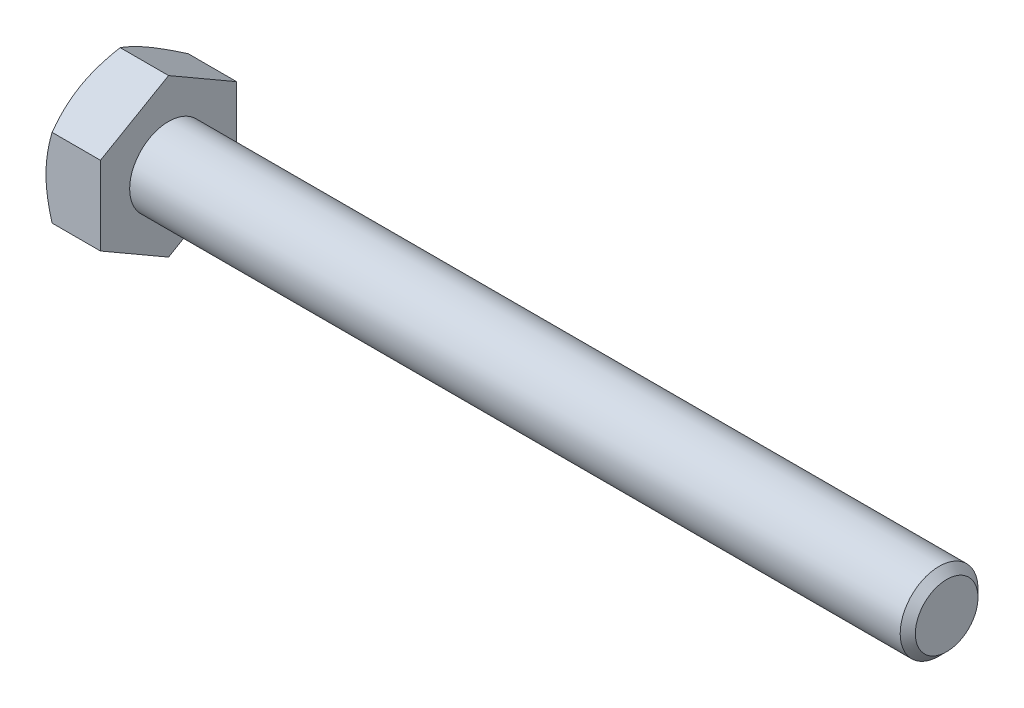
ISO-10303-21;
HEADER;
FILE_DESCRIPTION(('STEP AP214'),'2;1');
FILE_NAME('part.step','',(''),(''),'','','');
FILE_SCHEMA(('AUTOMOTIVE_DESIGN { 1 0 10303 214 1 1 1 1 }'));
ENDSEC;
DATA;
#1=APPLICATION_CONTEXT('core data for automotive mechanical design processes');
#2=APPLICATION_PROTOCOL_DEFINITION('international standard','automotive_design',2000,#1);
#3=PRODUCT_CONTEXT('',#1,'mechanical');
#4=PRODUCT('Part','Part','',(#3));
#5=PRODUCT_RELATED_PRODUCT_CATEGORY('part','',(#4));
#6=PRODUCT_DEFINITION_FORMATION('','',#4);
#7=PRODUCT_DEFINITION_CONTEXT('part definition',#1,'design');
#8=PRODUCT_DEFINITION('design','',#6,#7);
#9=PRODUCT_DEFINITION_SHAPE('','',#8);
#10=(LENGTH_UNIT() NAMED_UNIT(*) SI_UNIT(.MILLI.,.METRE.));
#11=(NAMED_UNIT(*) PLANE_ANGLE_UNIT() SI_UNIT($,.RADIAN.));
#12=(NAMED_UNIT(*) SI_UNIT($,.STERADIAN.) SOLID_ANGLE_UNIT());
#13=UNCERTAINTY_MEASURE_WITH_UNIT(LENGTH_MEASURE(1.E-05),#10,'distance_accuracy_value','');
#14=(GEOMETRIC_REPRESENTATION_CONTEXT(3) GLOBAL_UNCERTAINTY_ASSIGNED_CONTEXT((#13)) GLOBAL_UNIT_ASSIGNED_CONTEXT((#10,
#11,#12)) REPRESENTATION_CONTEXT('',''));
#15=CARTESIAN_POINT('',(0.,0.,0.));
#16=DIRECTION('',(0.,0.,1.));
#17=DIRECTION('',(1.,0.,0.));
#18=AXIS2_PLACEMENT_3D('',#15,#16,#17);
#19=CARTESIAN_POINT('',(2.8,2.02072594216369,-3.5));
#20=DIRECTION('',(0.,-0.866025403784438,0.500000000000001));
#21=DIRECTION('',(0.,-0.500000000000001,-0.866025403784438));
#22=AXIS2_PLACEMENT_3D('',#19,#20,#21);
#23=PLANE('',#22);
#24=CARTESIAN_POINT('',(0.312674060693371,4.04156735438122,0.0002));
#25=CARTESIAN_POINT('',(0.261385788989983,3.9527667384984,-0.15360717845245));
#26=CARTESIAN_POINT('',(0.214740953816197,3.86319960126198,-0.308742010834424));
#27=CARTESIAN_POINT('',(0.133321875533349,3.68251437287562,-0.621698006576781));
#28=CARTESIAN_POINT('',(0.0985764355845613,3.59139307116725,-0.779524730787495));
#29=CARTESIAN_POINT('',(0.0444900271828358,3.41027974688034,-1.09322221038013));
#30=CARTESIAN_POINT('',(0.024789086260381,3.32031559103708,-1.24904469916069));
#31=CARTESIAN_POINT('',(0.00127013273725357,3.13996396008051,-1.56142288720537));
#32=CARTESIAN_POINT('',(-0.00256735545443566,3.04957714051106,-1.71797745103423));
#33=CARTESIAN_POINT('',(0.00541530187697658,2.88068384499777,-2.01050921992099));
#34=CARTESIAN_POINT('',(0.0152754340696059,2.80215208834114,-2.14653021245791));
#35=CARTESIAN_POINT('',(0.046526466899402,2.64560020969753,-2.41768602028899));
#36=CARTESIAN_POINT('',(0.0679280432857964,2.56758062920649,-2.55281989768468));
#37=CARTESIAN_POINT('',(0.121430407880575,2.41070596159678,-2.82453479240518));
#38=CARTESIAN_POINT('',(0.153757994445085,2.33187072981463,-2.96108141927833));
#39=CARTESIAN_POINT('',(0.227128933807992,2.17537608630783,-3.2321380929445));
#40=CARTESIAN_POINT('',(0.268155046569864,2.09771466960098,-3.36665161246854));
#41=CARTESIAN_POINT('',(0.312674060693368,2.02061047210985,-3.5002));
#42=B_SPLINE_CURVE_WITH_KNOTS('',3,(#24,#25,#26,#27,#28,#29,#30,#31,#32,#33,#34,#35,#36,#37,#38,
#39,#40,#41),.UNSPECIFIED.,.F.,.F.,(4,2,2,2,2,2,2,2,4),(0.,0.554793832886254,1.11092123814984,
1.65328467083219,2.19498204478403,2.6666513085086,3.13875761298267,3.6213361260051,
4.10296698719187),.UNSPECIFIED.);
#43=CARTESIAN_POINT('',(0.312607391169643,4.04145188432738,0.));
#44=VERTEX_POINT('',#43);
#45=CARTESIAN_POINT('',(0.,3.03108891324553,-1.75));
#46=VERTEX_POINT('',#45);
#47=EDGE_CURVE('E55',#44,#46,#42,.T.);
#48=ORIENTED_EDGE('',*,*,#47,.F.);
#49=DIRECTION('',(-1.,0.,0.));
#50=VECTOR('',#49,1.);
#51=CARTESIAN_POINT('',(2.8,4.04145188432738,0.));
#52=LINE('',#51,#50);
#53=CARTESIAN_POINT('',(2.8,4.04145188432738,0.));
#54=VERTEX_POINT('',#53);
#55=EDGE_CURVE('E151',#54,#44,#52,.T.);
#56=ORIENTED_EDGE('',*,*,#55,.F.);
#57=DIRECTION('',(0.,0.500000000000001,0.866025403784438));
#58=VECTOR('',#57,1.);
#59=CARTESIAN_POINT('',(2.8,2.02072594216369,-3.5));
#60=LINE('',#59,#58);
#61=CARTESIAN_POINT('',(2.8,2.02072594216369,-3.5));
#62=VERTEX_POINT('',#61);
#63=EDGE_CURVE('E242',#62,#54,#60,.T.);
#64=ORIENTED_EDGE('',*,*,#63,.F.);
#65=DIRECTION('',(-1.,0.,0.));
#66=VECTOR('',#65,1.);
#67=CARTESIAN_POINT('',(2.8,2.02072594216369,-3.5));
#68=LINE('',#67,#66);
#69=CARTESIAN_POINT('',(0.31260739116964,2.02072594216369,-3.5));
#70=VERTEX_POINT('',#69);
#71=EDGE_CURVE('E139',#62,#70,#68,.T.);
#72=ORIENTED_EDGE('',*,*,#71,.T.);
#73=EDGE_CURVE('E133',#46,#70,#42,.T.);
#74=ORIENTED_EDGE('',*,*,#73,.F.);
#75=EDGE_LOOP('',(#48,#56,#64,#72,#74));
#76=FACE_BOUND('',#75,.T.);
#77=ADVANCED_FACE('F39',(#76),#23,.F.);
#78=CARTESIAN_POINT('',(2.8,4.04145188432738,0.));
#79=DIRECTION('',(0.,-0.866025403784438,-0.500000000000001));
#80=DIRECTION('',(0.,0.500000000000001,-0.866025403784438));
#81=AXIS2_PLACEMENT_3D('',#78,#79,#80);
#82=PLANE('',#81);
#83=CARTESIAN_POINT('',(0.312674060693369,2.02061047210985,3.5002));
#84=CARTESIAN_POINT('',(0.261385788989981,2.10941108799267,3.34639282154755));
#85=CARTESIAN_POINT('',(0.214740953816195,2.19897822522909,3.19125798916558));
#86=CARTESIAN_POINT('',(0.133321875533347,2.37966345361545,2.87830199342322));
#87=CARTESIAN_POINT('',(0.0985764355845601,2.47078475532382,2.72047526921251));
#88=CARTESIAN_POINT('',(0.0444900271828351,2.65189807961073,2.40677778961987));
#89=CARTESIAN_POINT('',(0.0247890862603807,2.74186223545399,2.25095530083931));
#90=CARTESIAN_POINT('',(0.00127013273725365,2.92221386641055,1.93857711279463));
#91=CARTESIAN_POINT('',(-0.00256735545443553,3.01260068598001,1.78202254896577));
#92=CARTESIAN_POINT('',(0.00541530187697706,3.1814939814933,1.48949078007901));
#93=CARTESIAN_POINT('',(0.0152754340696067,3.26002573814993,1.3534697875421));
#94=CARTESIAN_POINT('',(0.0465264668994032,3.41657761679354,1.08231397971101));
#95=CARTESIAN_POINT('',(0.0679280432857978,3.49459719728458,0.947180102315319));
#96=CARTESIAN_POINT('',(0.121430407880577,3.65147186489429,0.675465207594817));
#97=CARTESIAN_POINT('',(0.153757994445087,3.73030709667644,0.538918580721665));
#98=CARTESIAN_POINT('',(0.227128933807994,3.88680174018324,0.267861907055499));
#99=CARTESIAN_POINT('',(0.268155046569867,3.96446315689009,0.133348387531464));
#100=CARTESIAN_POINT('',(0.312674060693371,4.04156735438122,-0.000200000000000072));
#101=B_SPLINE_CURVE_WITH_KNOTS('',3,(#83,#84,#85,#86,#87,#88,#89,#90,#91,#92,#93,#94,#95,#96,
#97,#98,#99,#100),.UNSPECIFIED.,.F.,.F.,(4,2,2,2,2,2,2,2,4),(0.,0.554793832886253,
1.11092123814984,1.65328467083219,2.19498204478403,2.6666513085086,3.13875761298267,
3.6213361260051,4.10296698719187),.UNSPECIFIED.);
#102=CARTESIAN_POINT('',(0.312607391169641,2.02072594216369,3.5));
#103=VERTEX_POINT('',#102);
#104=CARTESIAN_POINT('',(0.,3.03108891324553,1.75));
#105=VERTEX_POINT('',#104);
#106=EDGE_CURVE('E62',#103,#105,#101,.T.);
#107=ORIENTED_EDGE('',*,*,#106,.F.);
#108=DIRECTION('',(-1.,0.,0.));
#109=VECTOR('',#108,1.);
#110=CARTESIAN_POINT('',(2.8,2.02072594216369,3.5));
#111=LINE('',#110,#109);
#112=CARTESIAN_POINT('',(2.8,2.02072594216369,3.5));
#113=VERTEX_POINT('',#112);
#114=EDGE_CURVE('E149',#113,#103,#111,.T.);
#115=ORIENTED_EDGE('',*,*,#114,.F.);
#116=DIRECTION('',(0.,-0.500000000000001,0.866025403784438));
#117=VECTOR('',#116,1.);
#118=CARTESIAN_POINT('',(2.8,4.04145188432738,0.));
#119=LINE('',#118,#117);
#120=EDGE_CURVE('E240',#54,#113,#119,.T.);
#121=ORIENTED_EDGE('',*,*,#120,.F.);
#122=ORIENTED_EDGE('',*,*,#55,.T.);
#123=EDGE_CURVE('E166',#105,#44,#101,.T.);
#124=ORIENTED_EDGE('',*,*,#123,.F.);
#125=EDGE_LOOP('',(#107,#115,#121,#122,#124));
#126=FACE_BOUND('',#125,.T.);
#127=ADVANCED_FACE('F172',(#126),#82,.F.);
#128=CARTESIAN_POINT('',(2.8,2.02072594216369,3.5));
#129=DIRECTION('',(0.,0.,-1.));
#130=DIRECTION('',(0.,1.,0.));
#131=AXIS2_PLACEMENT_3D('',#128,#129,#130);
#132=PLANE('',#131);
#133=CARTESIAN_POINT('',(1.74876972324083,-5.51155991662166,3.5));
#134=CARTESIAN_POINT('',(1.67392336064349,-5.35795146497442,3.5));
#135=CARTESIAN_POINT('',(1.59977092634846,-5.20399921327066,3.5));
#136=CARTESIAN_POINT('',(1.45324265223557,-4.89522455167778,3.5));
#137=CARTESIAN_POINT('',(1.38086707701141,-4.74040201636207,3.5));
#138=CARTESIAN_POINT('',(1.23793493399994,-4.42894615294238,3.5));
#139=CARTESIAN_POINT('',(1.1673897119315,-4.27230760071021,3.5));
#140=CARTESIAN_POINT('',(1.02907715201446,-3.95781335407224,3.5));
#141=CARTESIAN_POINT('',(0.961309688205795,-3.79995771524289,3.5));
#142=CARTESIAN_POINT('',(0.82704925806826,-3.47741113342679,3.5));
#143=CARTESIAN_POINT('',(0.760677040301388,-3.31266966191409,3.5));
#144=CARTESIAN_POINT('',(0.632756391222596,-2.9812905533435,3.5));
#145=CARTESIAN_POINT('',(0.571208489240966,-2.81465271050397,3.5));
#146=CARTESIAN_POINT('',(0.454490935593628,-2.47950135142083,3.5));
#147=CARTESIAN_POINT('',(0.399309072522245,-2.31099212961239,3.5));
#148=CARTESIAN_POINT('',(0.297038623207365,-1.97155788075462,3.5));
#149=CARTESIAN_POINT('',(0.249947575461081,-1.80063360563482,3.5));
#150=CARTESIAN_POINT('',(0.166312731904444,-1.4572176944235,3.5));
#151=CARTESIAN_POINT('',(0.129709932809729,-1.2847406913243,3.5));
#152=CARTESIAN_POINT('',(0.0690664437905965,-0.937557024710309,3.5));
#153=CARTESIAN_POINT('',(0.0450243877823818,-0.762850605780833,3.5));
#154=CARTESIAN_POINT('',(0.0117307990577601,-0.414396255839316,3.5));
#155=CARTESIAN_POINT('',(0.00228260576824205,-0.240667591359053,3.5));
#156=CARTESIAN_POINT('',(-0.00154556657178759,0.106974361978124,3.5));
#157=CARTESIAN_POINT('',(0.00407467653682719,0.280887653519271,3.5));
#158=CARTESIAN_POINT('',(0.0258160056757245,0.57367773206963,3.5));
#159=CARTESIAN_POINT('',(0.0381294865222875,0.692856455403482,3.5));
#160=CARTESIAN_POINT('',(0.0691104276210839,0.930390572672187,3.5));
#161=CARTESIAN_POINT('',(0.0877786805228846,1.04874586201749,3.5));
#162=CARTESIAN_POINT('',(0.152339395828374,1.40238821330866,3.5));
#163=CARTESIAN_POINT('',(0.206777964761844,1.63613518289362,3.5));
#164=CARTESIAN_POINT('',(0.301818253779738,1.98584040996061,3.5));
#165=CARTESIAN_POINT('',(0.336200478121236,2.10359260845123,3.5));
#166=CARTESIAN_POINT('',(0.408694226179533,2.33795453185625,3.5));
#167=CARTESIAN_POINT('',(0.44680577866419,2.45456424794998,3.5));
#168=CARTESIAN_POINT('',(0.526133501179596,2.68667648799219,3.5));
#169=CARTESIAN_POINT('',(0.567348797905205,2.80217931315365,3.5));
#170=CARTESIAN_POINT('',(0.652383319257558,3.03221622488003,3.5));
#171=CARTESIAN_POINT('',(0.696202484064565,3.14675033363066,3.5));
#172=CARTESIAN_POINT('',(0.817586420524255,3.45518824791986,3.5));
#173=CARTESIAN_POINT('',(0.897216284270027,3.64827858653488,3.5));
#174=CARTESIAN_POINT('',(1.06116121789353,4.03246734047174,3.5));
#175=CARTESIAN_POINT('',(1.14547680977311,4.22356553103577,3.5));
#176=CARTESIAN_POINT('',(1.31768022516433,4.60422080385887,3.5));
#177=CARTESIAN_POINT('',(1.40556928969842,4.79377732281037,3.5));
#178=CARTESIAN_POINT('',(1.5840729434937,5.17160543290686,3.5));
#179=CARTESIAN_POINT('',(1.67468761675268,5.3598769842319,3.5));
#180=CARTESIAN_POINT('',(1.85818750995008,5.73567568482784,3.5));
#181=CARTESIAN_POINT('',(1.95107608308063,5.92320119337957,3.5));
#182=CARTESIAN_POINT('',(2.13854805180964,6.29740401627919,3.5));
#183=CARTESIAN_POINT('',(2.23313146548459,6.48408132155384,3.5));
#184=CARTESIAN_POINT('',(2.51886265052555,7.04299370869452,3.5));
#185=CARTESIAN_POINT('',(2.71203324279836,7.41419418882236,3.5));
#186=CARTESIAN_POINT('',(3.08131090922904,8.11545297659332,3.5));
#187=CARTESIAN_POINT('',(3.257056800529,8.44570240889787,3.5));
#188=CARTESIAN_POINT('',(3.61066708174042,9.10509095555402,3.5));
#189=CARTESIAN_POINT('',(3.78853160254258,9.43422999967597,3.5));
#190=CARTESIAN_POINT('',(4.14522643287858,10.0905480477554,3.5));
#191=CARTESIAN_POINT('',(4.32405147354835,10.4177299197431,3.5));
#192=CARTESIAN_POINT('',(4.68290305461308,11.0714005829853,3.5));
#193=CARTESIAN_POINT('',(4.86292949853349,11.3978894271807,3.5));
#194=CARTESIAN_POINT('',(5.04339321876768,11.7241348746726,3.5));
#195=B_SPLINE_CURVE_WITH_KNOTS('',3,(#133,#134,#135,#136,#137,#138,#139,#140,#141,#142,#143,
#144,#145,#146,#147,#148,#149,#150,#151,#152,#153,#154,#155,#156,#157,#158,#159,#160,#161,#162,
#163,#164,#165,#166,#167,#168,#169,#170,#171,#172,#173,#174,#175,#176,#177,#178,#179,#180,#181,
#182,#183,#184,#185,#186,#187,#188,#189,#190,#191,#192,#193,#194),.UNSPECIFIED.,.F.,.F.,(4,2,2,
2,2,2,2,2,2,2,2,2,2,2,2,2,2,2,2,2,2,2,2,2,2,2,2,2,2,2,4),(0.,0.512624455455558,1.02532478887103,
1.54067716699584,2.05600615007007,2.58877526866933,3.12160276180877,3.65339055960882,
4.18501628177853,4.71358975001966,5.24210571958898,5.76343550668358,6.28477297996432,
6.64403977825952,7.00335140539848,7.72232402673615,8.09029790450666,8.45827462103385,
8.82614818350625,9.19401329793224,9.82051720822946,10.4470910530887,11.0738843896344,
11.7006970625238,12.3284975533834,12.9563047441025,14.211635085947,15.33392926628,
16.4562931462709,17.574877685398,18.6933734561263),.UNSPECIFIED.);
#196=CARTESIAN_POINT('',(0.31260739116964,-2.02072594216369,3.5));
#197=VERTEX_POINT('',#196);
#198=CARTESIAN_POINT('',(0.,0.,3.5));
#199=VERTEX_POINT('',#198);
#200=EDGE_CURVE('E252',#197,#199,#195,.T.);
#201=ORIENTED_EDGE('',*,*,#200,.F.);
#202=DIRECTION('',(-1.,0.,0.));
#203=VECTOR('',#202,1.);
#204=CARTESIAN_POINT('',(2.8,-2.02072594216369,3.5));
#205=LINE('',#204,#203);
#206=CARTESIAN_POINT('',(2.8,-2.02072594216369,3.5));
#207=VERTEX_POINT('',#206);
#208=EDGE_CURVE('E141',#207,#197,#205,.T.);
#209=ORIENTED_EDGE('',*,*,#208,.F.);
#210=DIRECTION('',(0.,-1.,0.));
#211=VECTOR('',#210,1.);
#212=CARTESIAN_POINT('',(2.8,2.02072594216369,3.5));
#213=LINE('',#212,#211);
#214=EDGE_CURVE('E236',#113,#207,#213,.T.);
#215=ORIENTED_EDGE('',*,*,#214,.F.);
#216=ORIENTED_EDGE('',*,*,#114,.T.);
#217=EDGE_CURVE('E190',#199,#103,#195,.T.);
#218=ORIENTED_EDGE('',*,*,#217,.F.);
#219=EDGE_LOOP('',(#201,#209,#215,#216,#218));
#220=FACE_BOUND('',#219,.T.);
#221=ADVANCED_FACE('F258',(#220),#132,.F.);
#222=CARTESIAN_POINT('',(2.8,-4.04145188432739,0.));
#223=DIRECTION('',(0.,0.866025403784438,-0.500000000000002));
#224=DIRECTION('',(0.,0.500000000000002,0.866025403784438));
#225=AXIS2_PLACEMENT_3D('',#222,#223,#224);
#226=PLANE('',#225);
#227=CARTESIAN_POINT('',(0.312674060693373,-4.04156735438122,-0.000200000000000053));
#228=CARTESIAN_POINT('',(0.261385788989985,-3.95276673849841,0.15360717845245));
#229=CARTESIAN_POINT('',(0.214740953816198,-3.86319960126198,0.308742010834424));
#230=CARTESIAN_POINT('',(0.13332187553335,-3.68251437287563,0.621698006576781));
#231=CARTESIAN_POINT('',(0.0985764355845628,-3.59139307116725,0.779524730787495));
#232=CARTESIAN_POINT('',(0.0444900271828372,-3.41027974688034,1.09322221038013));
#233=CARTESIAN_POINT('',(0.0247890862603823,-3.32031559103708,1.24904469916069));
#234=CARTESIAN_POINT('',(0.00127013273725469,-3.13996396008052,1.56142288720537));
#235=CARTESIAN_POINT('',(-0.00256735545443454,-3.04957714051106,1.71797745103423));
#236=CARTESIAN_POINT('',(0.00541530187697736,-2.88068384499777,2.01050921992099));
#237=CARTESIAN_POINT('',(0.0152754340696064,-2.80215208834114,2.14653021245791));
#238=CARTESIAN_POINT('',(0.0465264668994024,-2.64560020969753,2.41768602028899));
#239=CARTESIAN_POINT('',(0.067928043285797,-2.56758062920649,2.55281989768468));
#240=CARTESIAN_POINT('',(0.121430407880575,-2.41070596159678,2.82453479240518));
#241=CARTESIAN_POINT('',(0.153757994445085,-2.33187072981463,2.96108141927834));
#242=CARTESIAN_POINT('',(0.227128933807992,-2.17537608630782,3.2321380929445));
#243=CARTESIAN_POINT('',(0.268155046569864,-2.09771466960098,3.36665161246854));
#244=CARTESIAN_POINT('',(0.312674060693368,-2.02061047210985,3.5002));
#245=B_SPLINE_CURVE_WITH_KNOTS('',3,(#227,#228,#229,#230,#231,#232,#233,#234,#235,#236,#237,
#238,#239,#240,#241,#242,#243,#244),.UNSPECIFIED.,.F.,.F.,(4,2,2,2,2,2,2,2,4),(0.,
0.554793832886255,1.11092123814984,1.65328467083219,2.19498204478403,2.6666513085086,
3.13875761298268,3.6213361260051,4.10296698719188),.UNSPECIFIED.);
#246=CARTESIAN_POINT('',(0.312607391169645,-4.04145188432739,0.));
#247=VERTEX_POINT('',#246);
#248=CARTESIAN_POINT('',(0.,-3.03108891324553,1.75000000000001));
#249=VERTEX_POINT('',#248);
#250=EDGE_CURVE('E174',#247,#249,#245,.T.);
#251=ORIENTED_EDGE('',*,*,#250,.F.);
#252=DIRECTION('',(-1.,0.,0.));
#253=VECTOR('',#252,1.);
#254=CARTESIAN_POINT('',(2.8,-4.04145188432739,0.));
#255=LINE('',#254,#253);
#256=CARTESIAN_POINT('',(2.8,-4.04145188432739,0.));
#257=VERTEX_POINT('',#256);
#258=EDGE_CURVE('E138',#257,#247,#255,.T.);
#259=ORIENTED_EDGE('',*,*,#258,.F.);
#260=DIRECTION('',(0.,-0.500000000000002,-0.866025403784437));
#261=VECTOR('',#260,1.);
#262=CARTESIAN_POINT('',(2.8,-4.04145188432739,0.));
#263=LINE('',#262,#261);
#264=EDGE_CURVE('E234',#207,#257,#263,.T.);
#265=ORIENTED_EDGE('',*,*,#264,.F.);
#266=ORIENTED_EDGE('',*,*,#208,.T.);
#267=EDGE_CURVE('E176',#249,#197,#245,.T.);
#268=ORIENTED_EDGE('',*,*,#267,.F.);
#269=EDGE_LOOP('',(#251,#259,#265,#266,#268));
#270=FACE_BOUND('',#269,.T.);
#271=ADVANCED_FACE('F230',(#270),#226,.F.);
#272=CARTESIAN_POINT('',(2.8,-2.02072594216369,-3.5));
#273=DIRECTION('',(0.,0.866025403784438,0.5));
#274=DIRECTION('',(0.,-0.5,0.866025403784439));
#275=AXIS2_PLACEMENT_3D('',#272,#273,#274);
#276=PLANE('',#275);
#277=CARTESIAN_POINT('',(0.312674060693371,-2.02061047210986,-3.5002));
#278=CARTESIAN_POINT('',(0.261385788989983,-2.10941108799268,-3.34639282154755));
#279=CARTESIAN_POINT('',(0.214740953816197,-2.1989782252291,-3.19125798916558));
#280=CARTESIAN_POINT('',(0.13332187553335,-2.37966345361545,-2.87830199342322));
#281=CARTESIAN_POINT('',(0.0985764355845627,-2.47078475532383,-2.7204752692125));
#282=CARTESIAN_POINT('',(0.0444900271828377,-2.65189807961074,-2.40677778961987));
#283=CARTESIAN_POINT('',(0.0247890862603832,-2.741862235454,-2.25095530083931));
#284=CARTESIAN_POINT('',(0.00127013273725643,-2.92221386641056,-1.93857711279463));
#285=CARTESIAN_POINT('',(-0.00256735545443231,-3.01260068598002,-1.78202254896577));
#286=CARTESIAN_POINT('',(0.00541530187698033,-3.1814939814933,-1.48949078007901));
#287=CARTESIAN_POINT('',(0.0152754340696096,-3.26002573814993,-1.35346978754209));
#288=CARTESIAN_POINT('',(0.0465264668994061,-3.41657761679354,-1.08231397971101));
#289=CARTESIAN_POINT('',(0.0679280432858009,-3.49459719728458,-0.947180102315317));
#290=CARTESIAN_POINT('',(0.12143040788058,-3.65147186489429,-0.675465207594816));
#291=CARTESIAN_POINT('',(0.153757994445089,-3.73030709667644,-0.538918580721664));
#292=CARTESIAN_POINT('',(0.227128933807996,-3.88680174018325,-0.267861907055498));
#293=CARTESIAN_POINT('',(0.268155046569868,-3.96446315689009,-0.133348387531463));
#294=CARTESIAN_POINT('',(0.312674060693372,-4.04156735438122,0.000200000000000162));
#295=B_SPLINE_CURVE_WITH_KNOTS('',3,(#277,#278,#279,#280,#281,#282,#283,#284,#285,#286,#287,
#288,#289,#290,#291,#292,#293,#294),.UNSPECIFIED.,.F.,.F.,(4,2,2,2,2,2,2,2,4),(0.,
0.554793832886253,1.11092123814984,1.65328467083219,2.19498204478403,2.6666513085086,
3.13875761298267,3.6213361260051,4.10296698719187),.UNSPECIFIED.);
#296=CARTESIAN_POINT('',(0.312607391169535,-2.02072594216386,-3.5));
#297=VERTEX_POINT('',#296);
#298=CARTESIAN_POINT('',(0.,-3.03108891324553,-1.75));
#299=VERTEX_POINT('',#298);
#300=EDGE_CURVE('E115',#297,#299,#295,.T.);
#301=ORIENTED_EDGE('',*,*,#300,.F.);
#302=DIRECTION('',(-1.,0.,0.));
#303=VECTOR('',#302,1.);
#304=CARTESIAN_POINT('',(2.8,-2.02072594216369,-3.5));
#305=LINE('',#304,#303);
#306=CARTESIAN_POINT('',(2.8,-2.02072594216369,-3.5));
#307=VERTEX_POINT('',#306);
#308=EDGE_CURVE('E129',#307,#297,#305,.T.);
#309=ORIENTED_EDGE('',*,*,#308,.F.);
#310=DIRECTION('',(0.,0.5,-0.866025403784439));
#311=VECTOR('',#310,1.);
#312=CARTESIAN_POINT('',(2.8,-2.02072594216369,-3.5));
#313=LINE('',#312,#311);
#314=EDGE_CURVE('E232',#257,#307,#313,.T.);
#315=ORIENTED_EDGE('',*,*,#314,.F.);
#316=ORIENTED_EDGE('',*,*,#258,.T.);
#317=EDGE_CURVE('E132',#299,#247,#295,.T.);
#318=ORIENTED_EDGE('',*,*,#317,.F.);
#319=EDGE_LOOP('',(#301,#309,#315,#316,#318));
#320=FACE_BOUND('',#319,.T.);
#321=ADVANCED_FACE('F127',(#320),#276,.F.);
#322=CARTESIAN_POINT('',(2.8,2.02072594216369,-3.5));
#323=DIRECTION('',(0.,0.,1.));
#324=DIRECTION('',(0.,-1.,0.));
#325=AXIS2_PLACEMENT_3D('',#322,#323,#324);
#326=PLANE('',#325);
#327=CARTESIAN_POINT('',(1.74876972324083,-5.51155991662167,-3.5));
#328=CARTESIAN_POINT('',(1.6739233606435,-5.35795146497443,-3.5));
#329=CARTESIAN_POINT('',(1.59977092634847,-5.20399921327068,-3.5));
#330=CARTESIAN_POINT('',(1.45324265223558,-4.89522455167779,-3.5));
#331=CARTESIAN_POINT('',(1.38086707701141,-4.74040201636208,-3.5));
#332=CARTESIAN_POINT('',(1.23793493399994,-4.4289461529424,-3.5));
#333=CARTESIAN_POINT('',(1.1673897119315,-4.27230760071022,-3.5));
#334=CARTESIAN_POINT('',(1.02907715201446,-3.95781335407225,-3.5));
#335=CARTESIAN_POINT('',(0.9613096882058,-3.79995771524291,-3.5));
#336=CARTESIAN_POINT('',(0.827049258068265,-3.4774111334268,-3.5));
#337=CARTESIAN_POINT('',(0.760677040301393,-3.3126696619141,-3.5));
#338=CARTESIAN_POINT('',(0.632756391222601,-2.98129055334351,-3.5));
#339=CARTESIAN_POINT('',(0.57120848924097,-2.81465271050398,-3.5));
#340=CARTESIAN_POINT('',(0.454490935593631,-2.47950135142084,-3.5));
#341=CARTESIAN_POINT('',(0.399309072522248,-2.3109921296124,-3.5));
#342=CARTESIAN_POINT('',(0.297038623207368,-1.97155788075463,-3.5));
#343=CARTESIAN_POINT('',(0.249947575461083,-1.80063360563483,-3.5));
#344=CARTESIAN_POINT('',(0.166312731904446,-1.45721769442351,-3.5));
#345=CARTESIAN_POINT('',(0.12970993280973,-1.28474069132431,-3.5));
#346=CARTESIAN_POINT('',(0.0690664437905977,-0.937557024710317,-3.5));
#347=CARTESIAN_POINT('',(0.0450243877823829,-0.762850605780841,-3.5));
#348=CARTESIAN_POINT('',(0.0117307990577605,-0.414396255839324,-3.5));
#349=CARTESIAN_POINT('',(0.00228260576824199,-0.240667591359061,-3.5));
#350=CARTESIAN_POINT('',(-0.00154556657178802,0.106974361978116,-3.5));
#351=CARTESIAN_POINT('',(0.0040746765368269,0.280887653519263,-3.5));
#352=CARTESIAN_POINT('',(0.0258160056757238,0.573677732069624,-3.5));
#353=CARTESIAN_POINT('',(0.0381294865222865,0.692856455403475,-3.5));
#354=CARTESIAN_POINT('',(0.0691104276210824,0.93039057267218,-3.5));
#355=CARTESIAN_POINT('',(0.0877786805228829,1.04874586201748,-3.5));
#356=CARTESIAN_POINT('',(0.152339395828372,1.40238821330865,-3.5));
#357=CARTESIAN_POINT('',(0.206777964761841,1.63613518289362,-3.5));
#358=CARTESIAN_POINT('',(0.301818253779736,1.9858404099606,-3.5));
#359=CARTESIAN_POINT('',(0.336200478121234,2.10359260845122,-3.5));
#360=CARTESIAN_POINT('',(0.40869422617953,2.33795453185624,-3.5));
#361=CARTESIAN_POINT('',(0.446805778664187,2.45456424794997,-3.5));
#362=CARTESIAN_POINT('',(0.526133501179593,2.68667648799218,-3.5));
#363=CARTESIAN_POINT('',(0.567348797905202,2.80217931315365,-3.5));
#364=CARTESIAN_POINT('',(0.652383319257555,3.03221622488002,-3.5));
#365=CARTESIAN_POINT('',(0.696202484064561,3.14675033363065,-3.5));
#366=CARTESIAN_POINT('',(0.817586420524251,3.45518824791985,-3.5));
#367=CARTESIAN_POINT('',(0.897216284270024,3.64827858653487,-3.5));
#368=CARTESIAN_POINT('',(1.06116121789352,4.03246734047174,-3.5));
#369=CARTESIAN_POINT('',(1.1454768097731,4.22356553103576,-3.5));
#370=CARTESIAN_POINT('',(1.31768022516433,4.60422080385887,-3.5));
#371=CARTESIAN_POINT('',(1.40556928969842,4.79377732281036,-3.5));
#372=CARTESIAN_POINT('',(1.58407294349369,5.17160543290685,-3.5));
#373=CARTESIAN_POINT('',(1.67468761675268,5.35987698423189,-3.5));
#374=CARTESIAN_POINT('',(1.85818750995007,5.73567568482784,-3.5));
#375=CARTESIAN_POINT('',(1.95107608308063,5.92320119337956,-3.5));
#376=CARTESIAN_POINT('',(2.13854805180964,6.29740401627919,-3.5));
#377=CARTESIAN_POINT('',(2.23313146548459,6.48408132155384,-3.5));
#378=CARTESIAN_POINT('',(2.51886265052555,7.04299370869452,-3.5));
#379=CARTESIAN_POINT('',(2.71203324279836,7.41419418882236,-3.5));
#380=CARTESIAN_POINT('',(3.08131090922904,8.11545297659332,-3.5));
#381=CARTESIAN_POINT('',(3.257056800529,8.44570240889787,-3.5));
#382=CARTESIAN_POINT('',(3.61066708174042,9.10509095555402,-3.5));
#383=CARTESIAN_POINT('',(3.78853160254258,9.43422999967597,-3.5));
#384=CARTESIAN_POINT('',(4.14522643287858,10.0905480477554,-3.5));
#385=CARTESIAN_POINT('',(4.32405147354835,10.4177299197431,-3.5));
#386=CARTESIAN_POINT('',(4.68290305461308,11.0714005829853,-3.5));
#387=CARTESIAN_POINT('',(4.86292949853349,11.3978894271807,-3.5));
#388=CARTESIAN_POINT('',(5.04339321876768,11.7241348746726,-3.5));
#389=B_SPLINE_CURVE_WITH_KNOTS('',3,(#327,#328,#329,#330,#331,#332,#333,#334,#335,#336,#337,
#338,#339,#340,#341,#342,#343,#344,#345,#346,#347,#348,#349,#350,#351,#352,#353,#354,#355,#356,
#357,#358,#359,#360,#361,#362,#363,#364,#365,#366,#367,#368,#369,#370,#371,#372,#373,#374,#375,
#376,#377,#378,#379,#380,#381,#382,#383,#384,#385,#386,#387,#388),.UNSPECIFIED.,.F.,.F.,(4,2,2,
2,2,2,2,2,2,2,2,2,2,2,2,2,2,2,2,2,2,2,2,2,2,2,2,2,2,2,4),(0.,0.512624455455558,1.02532478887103,
1.54067716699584,2.05600615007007,2.58877526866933,3.12160276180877,3.65339055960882,
4.18501628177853,4.71358975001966,5.24210571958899,5.76343550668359,6.28477297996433,
6.64403977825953,7.00335140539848,7.72232402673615,8.09029790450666,8.45827462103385,
8.82614818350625,9.19401329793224,9.82051720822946,10.4470910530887,11.0738843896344,
11.7006970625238,12.3284975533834,12.9563047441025,14.211635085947,15.3339292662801,
16.4562931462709,17.574877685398,18.6933734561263),.UNSPECIFIED.);
#390=CARTESIAN_POINT('',(0.,0.,-3.5));
#391=VERTEX_POINT('',#390);
#392=EDGE_CURVE('E121',#70,#391,#389,.F.);
#393=ORIENTED_EDGE('',*,*,#392,.F.);
#394=ORIENTED_EDGE('',*,*,#71,.F.);
#395=DIRECTION('',(0.,1.,0.));
#396=VECTOR('',#395,1.);
#397=CARTESIAN_POINT('',(2.8,2.02072594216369,-3.5));
#398=LINE('',#397,#396);
#399=EDGE_CURVE('E137',#307,#62,#398,.T.);
#400=ORIENTED_EDGE('',*,*,#399,.F.);
#401=ORIENTED_EDGE('',*,*,#308,.T.);
#402=EDGE_CURVE('E112',#391,#297,#389,.F.);
#403=ORIENTED_EDGE('',*,*,#402,.F.);
#404=EDGE_LOOP('',(#393,#394,#400,#401,#403));
#405=FACE_BOUND('',#404,.T.);
#406=ADVANCED_FACE('F135',(#405),#326,.F.);
#407=CARTESIAN_POINT('',(2.8,4.04145188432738,0.));
#408=DIRECTION('',(1.,0.,0.));
#409=DIRECTION('',(0.,0.,-1.));
#410=AXIS2_PLACEMENT_3D('',#407,#408,#409);
#411=PLANE('',#410);
#412=CARTESIAN_POINT('',(2.8,0.,0.));
#413=DIRECTION('',(1.,0.,0.));
#414=DIRECTION('',(0.,0.,-1.));
#415=AXIS2_PLACEMENT_3D('',#412,#413,#414);
#416=CIRCLE('',#415,2.);
#417=CARTESIAN_POINT('',(2.8,0.,-2.));
#418=VERTEX_POINT('',#417);
#419=EDGE_CURVE('E245',#418,#418,#416,.F.);
#420=ORIENTED_EDGE('',*,*,#419,.T.);
#421=EDGE_LOOP('',(#420));
#422=FACE_BOUND('',#421,.T.);
#423=ORIENTED_EDGE('',*,*,#63,.T.);
#424=ORIENTED_EDGE('',*,*,#120,.T.);
#425=ORIENTED_EDGE('',*,*,#214,.T.);
#426=ORIENTED_EDGE('',*,*,#264,.T.);
#427=ORIENTED_EDGE('',*,*,#314,.T.);
#428=ORIENTED_EDGE('',*,*,#399,.T.);
#429=EDGE_LOOP('',(#423,#424,#425,#426,#427,#428));
#430=FACE_BOUND('',#429,.T.);
#431=ADVANCED_FACE('F260',(#422,#430),#411,.T.);
#432=CARTESIAN_POINT('',(0.,0.,0.));
#433=DIRECTION('',(-1.,0.,0.));
#434=DIRECTION('',(0.,0.,1.));
#435=AXIS2_PLACEMENT_3D('',#432,#433,#434);
#436=CYLINDRICAL_SURFACE('',#435,2.);
#437=ORIENTED_EDGE('',*,*,#419,.F.);
#438=EDGE_LOOP('',(#437));
#439=FACE_BOUND('',#438,.T.);
#440=CARTESIAN_POINT('',(42.41,0.,0.));
#441=DIRECTION('',(-1.,0.,0.));
#442=DIRECTION('',(0.,0.,1.));
#443=AXIS2_PLACEMENT_3D('',#440,#441,#442);
#444=CIRCLE('',#443,2.);
#445=CARTESIAN_POINT('',(42.41,0.,2.));
#446=VERTEX_POINT('',#445);
#447=EDGE_CURVE('E248',#446,#446,#444,.T.);
#448=ORIENTED_EDGE('',*,*,#447,.T.);
#449=EDGE_LOOP('',(#448));
#450=FACE_BOUND('',#449,.T.);
#451=ADVANCED_FACE('F291',(#439,#450),#436,.T.);
#452=CARTESIAN_POINT('',(42.8,0.,0.));
#453=DIRECTION('',(-1.,0.,0.));
#454=DIRECTION('',(0.,0.,1.));
#455=AXIS2_PLACEMENT_3D('',#452,#453,#454);
#456=CONICAL_SURFACE('',#455,1.61,0.785398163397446);
#457=ORIENTED_EDGE('',*,*,#447,.F.);
#458=EDGE_LOOP('',(#457));
#459=FACE_BOUND('',#458,.T.);
#460=CARTESIAN_POINT('',(42.8,0.,0.));
#461=DIRECTION('',(-1.,0.,0.));
#462=DIRECTION('',(0.,0.,1.));
#463=AXIS2_PLACEMENT_3D('',#460,#461,#462);
#464=CIRCLE('',#463,1.61);
#465=CARTESIAN_POINT('',(42.8,0.,1.61));
#466=VERTEX_POINT('',#465);
#467=EDGE_CURVE('E250',#466,#466,#464,.T.);
#468=ORIENTED_EDGE('',*,*,#467,.T.);
#469=EDGE_LOOP('',(#468));
#470=FACE_BOUND('',#469,.T.);
#471=ADVANCED_FACE('F294',(#459,#470),#456,.T.);
#472=CARTESIAN_POINT('',(42.8,0.,0.));
#473=DIRECTION('',(-1.,0.,0.));
#474=DIRECTION('',(0.,0.,1.));
#475=AXIS2_PLACEMENT_3D('',#472,#473,#474);
#476=PLANE('',#475);
#477=ORIENTED_EDGE('',*,*,#467,.F.);
#478=EDGE_LOOP('',(#477));
#479=FACE_BOUND('',#478,.T.);
#480=ADVANCED_FACE('F204',(#479),#476,.F.);
#481=CARTESIAN_POINT('',(0.,0.,0.));
#482=DIRECTION('',(1.,0.,0.));
#483=DIRECTION('',(0.,0.,-1.));
#484=AXIS2_PLACEMENT_3D('',#481,#482,#483);
#485=CONICAL_SURFACE('',#484,3.5,1.0471975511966);
#486=ORIENTED_EDGE('',*,*,#300,.T.);
#487=CARTESIAN_POINT('',(0.,0.,0.));
#488=DIRECTION('',(1.,0.,0.));
#489=DIRECTION('',(0.,0.,-1.));
#490=AXIS2_PLACEMENT_3D('',#487,#488,#489);
#491=CIRCLE('',#490,3.5);
#492=EDGE_CURVE('E43',#299,#391,#491,.T.);
#493=ORIENTED_EDGE('',*,*,#492,.T.);
#494=ORIENTED_EDGE('',*,*,#402,.T.);
#495=EDGE_LOOP('',(#486,#493,#494));
#496=FACE_BOUND('',#495,.T.);
#497=ADVANCED_FACE('F114',(#496),#485,.T.);
#498=ORIENTED_EDGE('',*,*,#250,.T.);
#499=EDGE_CURVE('E156',#249,#299,#491,.T.);
#500=ORIENTED_EDGE('',*,*,#499,.T.);
#501=ORIENTED_EDGE('',*,*,#317,.T.);
#502=EDGE_LOOP('',(#498,#500,#501));
#503=FACE_BOUND('',#502,.T.);
#504=ADVANCED_FACE('F203',(#503),#485,.T.);
#505=ORIENTED_EDGE('',*,*,#200,.T.);
#506=EDGE_CURVE('E157',#199,#249,#491,.T.);
#507=ORIENTED_EDGE('',*,*,#506,.T.);
#508=ORIENTED_EDGE('',*,*,#267,.T.);
#509=EDGE_LOOP('',(#505,#507,#508));
#510=FACE_BOUND('',#509,.T.);
#511=ADVANCED_FACE('F198',(#510),#485,.T.);
#512=ORIENTED_EDGE('',*,*,#217,.T.);
#513=ORIENTED_EDGE('',*,*,#106,.T.);
#514=CARTESIAN_POINT('',(0.,0.,0.));
#515=DIRECTION('',(-1.,0.,0.));
#516=DIRECTION('',(0.,0.,1.));
#517=AXIS2_PLACEMENT_3D('',#514,#515,#516);
#518=CIRCLE('',#517,3.5);
#519=EDGE_CURVE('E122',#199,#105,#518,.T.);
#520=ORIENTED_EDGE('',*,*,#519,.F.);
#521=EDGE_LOOP('',(#512,#513,#520));
#522=FACE_BOUND('',#521,.T.);
#523=ADVANCED_FACE('F202',(#522),#485,.T.);
#524=ORIENTED_EDGE('',*,*,#123,.T.);
#525=ORIENTED_EDGE('',*,*,#47,.T.);
#526=EDGE_CURVE('E48',#46,#105,#491,.T.);
#527=ORIENTED_EDGE('',*,*,#526,.T.);
#528=EDGE_LOOP('',(#524,#525,#527));
#529=FACE_BOUND('',#528,.T.);
#530=ADVANCED_FACE('F165',(#529),#485,.T.);
#531=ORIENTED_EDGE('',*,*,#73,.T.);
#532=ORIENTED_EDGE('',*,*,#392,.T.);
#533=EDGE_CURVE('E11',#391,#46,#491,.T.);
#534=ORIENTED_EDGE('',*,*,#533,.T.);
#535=EDGE_LOOP('',(#531,#532,#534));
#536=FACE_BOUND('',#535,.T.);
#537=ADVANCED_FACE('F263',(#536),#485,.T.);
#538=CARTESIAN_POINT('',(0.,4.04145188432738,0.));
#539=DIRECTION('',(1.,0.,0.));
#540=DIRECTION('',(0.,0.,-1.));
#541=AXIS2_PLACEMENT_3D('',#538,#539,#540);
#542=PLANE('',#541);
#543=ORIENTED_EDGE('',*,*,#533,.F.);
#544=ORIENTED_EDGE('',*,*,#492,.F.);
#545=ORIENTED_EDGE('',*,*,#499,.F.);
#546=ORIENTED_EDGE('',*,*,#506,.F.);
#547=ORIENTED_EDGE('',*,*,#519,.T.);
#548=ORIENTED_EDGE('',*,*,#526,.F.);
#549=EDGE_LOOP('',(#543,#544,#545,#546,#547,#548));
#550=FACE_BOUND('',#549,.T.);
#551=ADVANCED_FACE('F169',(#550),#542,.F.);
#552=CLOSED_SHELL('',(#77,#127,#221,#271,#321,#406,#431,#451,#471,#480,#497,#504,#511,#523,#530,
#537,#551));
#553=MANIFOLD_SOLID_BREP('B2',#552);
#554=ADVANCED_BREP_SHAPE_REPRESENTATION('',(#18,#553),#14);
#555=SHAPE_DEFINITION_REPRESENTATION(#9,#554);
ENDSEC;
END-ISO-10303-21;
